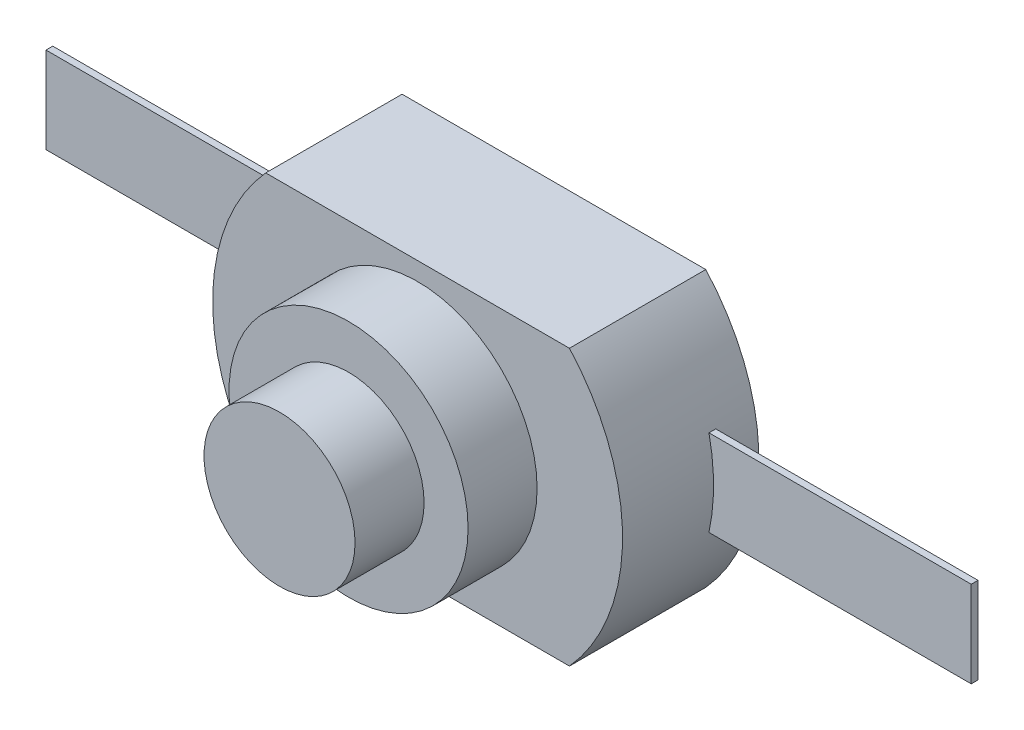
ISO-10303-21;
HEADER;
FILE_DESCRIPTION(('STEP AP214'),'2;1');
FILE_NAME('part.step','',(''),(''),'','','');
FILE_SCHEMA(('AUTOMOTIVE_DESIGN { 1 0 10303 214 1 1 1 1 }'));
ENDSEC;
DATA;
#1=APPLICATION_CONTEXT('core data for automotive mechanical design processes');
#2=APPLICATION_PROTOCOL_DEFINITION('international standard','automotive_design',2000,#1);
#3=PRODUCT_CONTEXT('',#1,'mechanical');
#4=PRODUCT('Part','Part','',(#3));
#5=PRODUCT_RELATED_PRODUCT_CATEGORY('part','',(#4));
#6=PRODUCT_DEFINITION_FORMATION('','',#4);
#7=PRODUCT_DEFINITION_CONTEXT('part definition',#1,'design');
#8=PRODUCT_DEFINITION('design','',#6,#7);
#9=PRODUCT_DEFINITION_SHAPE('','',#8);
#10=(LENGTH_UNIT() NAMED_UNIT(*) SI_UNIT(.MILLI.,.METRE.));
#11=(NAMED_UNIT(*) PLANE_ANGLE_UNIT() SI_UNIT($,.RADIAN.));
#12=(NAMED_UNIT(*) SI_UNIT($,.STERADIAN.) SOLID_ANGLE_UNIT());
#13=UNCERTAINTY_MEASURE_WITH_UNIT(LENGTH_MEASURE(1.E-05),#10,'distance_accuracy_value','');
#14=(GEOMETRIC_REPRESENTATION_CONTEXT(3) GLOBAL_UNCERTAINTY_ASSIGNED_CONTEXT((#13)) GLOBAL_UNIT_ASSIGNED_CONTEXT((#10,
#11,#12)) REPRESENTATION_CONTEXT('',''));
#15=CARTESIAN_POINT('',(0.,0.,0.));
#16=DIRECTION('',(0.,0.,1.));
#17=DIRECTION('',(1.,0.,0.));
#18=AXIS2_PLACEMENT_3D('',#15,#16,#17);
#19=CARTESIAN_POINT('',(0.,0.,4.0132));
#20=DIRECTION('',(0.,0.,-1.));
#21=DIRECTION('',(-1.,0.,0.));
#22=AXIS2_PLACEMENT_3D('',#19,#20,#21);
#23=CYLINDRICAL_SURFACE('',#22,6.0325);
#24=CARTESIAN_POINT('',(0.,0.,1.13500286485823));
#25=DIRECTION('',(0.,0.,1.));
#26=DIRECTION('',(1.,0.,0.));
#27=AXIS2_PLACEMENT_3D('',#24,#25,#26);
#28=CIRCLE('',#27,6.0325);
#29=CARTESIAN_POINT('',(-5.89730075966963,1.27,1.13500286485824));
#30=VERTEX_POINT('',#29);
#31=CARTESIAN_POINT('',(-5.89730075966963,-1.27,1.13500286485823));
#32=VERTEX_POINT('',#31);
#33=EDGE_CURVE('E52',#30,#32,#28,.T.);
#34=ORIENTED_EDGE('',*,*,#33,.F.);
#35=DIRECTION('',(0.,0.,-1.));
#36=VECTOR('',#35,1.);
#37=CARTESIAN_POINT('',(-5.89730075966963,1.27,4.0132));
#38=LINE('',#37,#36);
#39=CARTESIAN_POINT('',(-5.89730075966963,1.27,1.33422764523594));
#40=VERTEX_POINT('',#39);
#41=EDGE_CURVE('E47',#30,#40,#38,.F.);
#42=ORIENTED_EDGE('',*,*,#41,.T.);
#43=CARTESIAN_POINT('',(0.,0.,1.33422764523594));
#44=DIRECTION('',(0.,0.,-1.));
#45=DIRECTION('',(-1.,0.,0.));
#46=AXIS2_PLACEMENT_3D('',#43,#44,#45);
#47=CIRCLE('',#46,6.0325);
#48=CARTESIAN_POINT('',(-5.89730075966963,-1.27,1.33422764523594));
#49=VERTEX_POINT('',#48);
#50=EDGE_CURVE('E125',#49,#40,#47,.T.);
#51=ORIENTED_EDGE('',*,*,#50,.F.);
#52=DIRECTION('',(0.,0.,-1.));
#53=VECTOR('',#52,1.);
#54=CARTESIAN_POINT('',(-5.89730075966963,-1.27,4.0132));
#55=LINE('',#54,#53);
#56=EDGE_CURVE('E143',#32,#49,#55,.F.);
#57=ORIENTED_EDGE('',*,*,#56,.F.);
#58=EDGE_LOOP('',(#34,#42,#51,#57));
#59=FACE_BOUND('',#58,.T.);
#60=CARTESIAN_POINT('',(0.,0.,0.));
#61=DIRECTION('',(0.,0.,1.));
#62=DIRECTION('',(1.,0.,0.));
#63=AXIS2_PLACEMENT_3D('',#60,#61,#62);
#64=CIRCLE('',#63,6.0325);
#65=CARTESIAN_POINT('',(-4.4696783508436,4.0513,0.));
#66=VERTEX_POINT('',#65);
#67=CARTESIAN_POINT('',(-4.4696783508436,-4.0513,0.));
#68=VERTEX_POINT('',#67);
#69=EDGE_CURVE('E166',#66,#68,#64,.T.);
#70=ORIENTED_EDGE('',*,*,#69,.T.);
#71=DIRECTION('',(0.,0.,-1.));
#72=VECTOR('',#71,1.);
#73=CARTESIAN_POINT('',(-4.4696783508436,-4.0513,4.0132));
#74=LINE('',#73,#72);
#75=CARTESIAN_POINT('',(-4.4696783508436,-4.0513,4.0132));
#76=VERTEX_POINT('',#75);
#77=EDGE_CURVE('E195',#76,#68,#74,.T.);
#78=ORIENTED_EDGE('',*,*,#77,.F.);
#79=CARTESIAN_POINT('',(0.,0.,4.0132));
#80=DIRECTION('',(0.,0.,1.));
#81=DIRECTION('',(1.,0.,0.));
#82=AXIS2_PLACEMENT_3D('',#79,#80,#81);
#83=CIRCLE('',#82,6.0325);
#84=CARTESIAN_POINT('',(-4.4696783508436,4.0513,4.0132));
#85=VERTEX_POINT('',#84);
#86=EDGE_CURVE('E169',#85,#76,#83,.T.);
#87=ORIENTED_EDGE('',*,*,#86,.F.);
#88=DIRECTION('',(0.,0.,-1.));
#89=VECTOR('',#88,1.);
#90=CARTESIAN_POINT('',(-4.4696783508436,4.0513,4.0132));
#91=LINE('',#90,#89);
#92=EDGE_CURVE('E179',#85,#66,#91,.T.);
#93=ORIENTED_EDGE('',*,*,#92,.T.);
#94=EDGE_LOOP('',(#70,#78,#87,#93));
#95=FACE_BOUND('',#94,.T.);
#96=ADVANCED_FACE('F33',(#59,#95),#23,.T.);
#97=CARTESIAN_POINT('',(-4.4696783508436,-4.0513,4.0132));
#98=DIRECTION('',(0.,1.,0.));
#99=DIRECTION('',(-1.,0.,0.));
#100=AXIS2_PLACEMENT_3D('',#97,#98,#99);
#101=PLANE('',#100);
#102=DIRECTION('',(1.,0.,0.));
#103=VECTOR('',#102,1.);
#104=CARTESIAN_POINT('',(-4.4696783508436,-4.0513,0.));
#105=LINE('',#104,#103);
#106=CARTESIAN_POINT('',(4.4696783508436,-4.0513,0.));
#107=VERTEX_POINT('',#106);
#108=EDGE_CURVE('E182',#68,#107,#105,.T.);
#109=ORIENTED_EDGE('',*,*,#108,.T.);
#110=DIRECTION('',(0.,0.,-1.));
#111=VECTOR('',#110,1.);
#112=CARTESIAN_POINT('',(4.4696783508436,-4.0513,4.0132));
#113=LINE('',#112,#111);
#114=CARTESIAN_POINT('',(4.4696783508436,-4.0513,4.0132));
#115=VERTEX_POINT('',#114);
#116=EDGE_CURVE('E192',#115,#107,#113,.T.);
#117=ORIENTED_EDGE('',*,*,#116,.F.);
#118=DIRECTION('',(1.,0.,0.));
#119=VECTOR('',#118,1.);
#120=CARTESIAN_POINT('',(-4.4696783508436,-4.0513,4.0132));
#121=LINE('',#120,#119);
#122=EDGE_CURVE('E172',#76,#115,#121,.T.);
#123=ORIENTED_EDGE('',*,*,#122,.F.);
#124=ORIENTED_EDGE('',*,*,#77,.T.);
#125=EDGE_LOOP('',(#109,#117,#123,#124));
#126=FACE_BOUND('',#125,.T.);
#127=ADVANCED_FACE('F244',(#126),#101,.F.);
#128=CARTESIAN_POINT('',(0.,0.,4.0132));
#129=DIRECTION('',(0.,0.,-1.));
#130=DIRECTION('',(-1.,0.,0.));
#131=AXIS2_PLACEMENT_3D('',#128,#129,#130);
#132=CYLINDRICAL_SURFACE('',#131,6.0325);
#133=CARTESIAN_POINT('',(0.,0.,1.33422764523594));
#134=DIRECTION('',(0.,0.,-1.));
#135=DIRECTION('',(-1.,0.,0.));
#136=AXIS2_PLACEMENT_3D('',#133,#134,#135);
#137=CIRCLE('',#136,6.0325);
#138=CARTESIAN_POINT('',(5.89730075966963,1.27,1.33422764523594));
#139=VERTEX_POINT('',#138);
#140=CARTESIAN_POINT('',(5.89730075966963,-1.27,1.33422764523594));
#141=VERTEX_POINT('',#140);
#142=EDGE_CURVE('E40',#139,#141,#137,.T.);
#143=ORIENTED_EDGE('',*,*,#142,.F.);
#144=DIRECTION('',(0.,0.,-1.));
#145=VECTOR('',#144,1.);
#146=CARTESIAN_POINT('',(5.89730075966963,1.27,4.0132));
#147=LINE('',#146,#145);
#148=CARTESIAN_POINT('',(5.89730075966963,1.27,1.13500286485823));
#149=VERTEX_POINT('',#148);
#150=EDGE_CURVE('E11',#139,#149,#147,.T.);
#151=ORIENTED_EDGE('',*,*,#150,.T.);
#152=CARTESIAN_POINT('',(0.,0.,1.13500286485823));
#153=DIRECTION('',(0.,0.,1.));
#154=DIRECTION('',(1.,0.,0.));
#155=AXIS2_PLACEMENT_3D('',#152,#153,#154);
#156=CIRCLE('',#155,6.0325);
#157=CARTESIAN_POINT('',(5.89730075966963,-1.27,1.13500286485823));
#158=VERTEX_POINT('',#157);
#159=EDGE_CURVE('E201',#158,#149,#156,.T.);
#160=ORIENTED_EDGE('',*,*,#159,.F.);
#161=DIRECTION('',(0.,0.,-1.));
#162=VECTOR('',#161,1.);
#163=CARTESIAN_POINT('',(5.89730075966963,-1.27,4.0132));
#164=LINE('',#163,#162);
#165=EDGE_CURVE('E198',#141,#158,#164,.T.);
#166=ORIENTED_EDGE('',*,*,#165,.F.);
#167=EDGE_LOOP('',(#143,#151,#160,#166));
#168=FACE_BOUND('',#167,.T.);
#169=CARTESIAN_POINT('',(0.,0.,0.));
#170=DIRECTION('',(0.,0.,1.));
#171=DIRECTION('',(1.,0.,0.));
#172=AXIS2_PLACEMENT_3D('',#169,#170,#171);
#173=CIRCLE('',#172,6.0325);
#174=CARTESIAN_POINT('',(4.4696783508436,4.0513,0.));
#175=VERTEX_POINT('',#174);
#176=EDGE_CURVE('E184',#107,#175,#173,.T.);
#177=ORIENTED_EDGE('',*,*,#176,.T.);
#178=DIRECTION('',(0.,0.,-1.));
#179=VECTOR('',#178,1.);
#180=CARTESIAN_POINT('',(4.4696783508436,4.0513,4.0132));
#181=LINE('',#180,#179);
#182=CARTESIAN_POINT('',(4.4696783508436,4.0513,4.0132));
#183=VERTEX_POINT('',#182);
#184=EDGE_CURVE('E189',#183,#175,#181,.T.);
#185=ORIENTED_EDGE('',*,*,#184,.F.);
#186=CARTESIAN_POINT('',(0.,0.,4.0132));
#187=DIRECTION('',(0.,0.,1.));
#188=DIRECTION('',(1.,0.,0.));
#189=AXIS2_PLACEMENT_3D('',#186,#187,#188);
#190=CIRCLE('',#189,6.0325);
#191=EDGE_CURVE('E175',#115,#183,#190,.T.);
#192=ORIENTED_EDGE('',*,*,#191,.F.);
#193=ORIENTED_EDGE('',*,*,#116,.T.);
#194=EDGE_LOOP('',(#177,#185,#192,#193));
#195=FACE_BOUND('',#194,.T.);
#196=ADVANCED_FACE('F240',(#168,#195),#132,.T.);
#197=CARTESIAN_POINT('',(-4.4696783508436,4.0513,4.0132));
#198=DIRECTION('',(0.,-1.,0.));
#199=DIRECTION('',(0.,0.,-1.));
#200=AXIS2_PLACEMENT_3D('',#197,#198,#199);
#201=PLANE('',#200);
#202=DIRECTION('',(-1.,0.,0.));
#203=VECTOR('',#202,1.);
#204=CARTESIAN_POINT('',(-4.4696783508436,4.0513,0.));
#205=LINE('',#204,#203);
#206=EDGE_CURVE('E173',#175,#66,#205,.T.);
#207=ORIENTED_EDGE('',*,*,#206,.T.);
#208=ORIENTED_EDGE('',*,*,#92,.F.);
#209=DIRECTION('',(-1.,0.,0.));
#210=VECTOR('',#209,1.);
#211=CARTESIAN_POINT('',(-4.4696783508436,4.0513,4.0132));
#212=LINE('',#211,#210);
#213=EDGE_CURVE('E177',#183,#85,#212,.T.);
#214=ORIENTED_EDGE('',*,*,#213,.F.);
#215=ORIENTED_EDGE('',*,*,#184,.T.);
#216=EDGE_LOOP('',(#207,#208,#214,#215));
#217=FACE_BOUND('',#216,.T.);
#218=ADVANCED_FACE('F243',(#217),#201,.F.);
#219=CARTESIAN_POINT('',(0.,0.,4.0132));
#220=DIRECTION('',(0.,0.,1.));
#221=DIRECTION('',(1.,0.,0.));
#222=AXIS2_PLACEMENT_3D('',#219,#220,#221);
#223=PLANE('',#222);
#224=CARTESIAN_POINT('',(0.,0.,4.0132));
#225=DIRECTION('',(0.,0.,1.));
#226=DIRECTION('',(1.,0.,0.));
#227=AXIS2_PLACEMENT_3D('',#224,#225,#226);
#228=CIRCLE('',#227,3.5179);
#229=CARTESIAN_POINT('',(3.5179,0.,4.0132));
#230=VERTEX_POINT('',#229);
#231=EDGE_CURVE('E160',#230,#230,#228,.T.);
#232=ORIENTED_EDGE('',*,*,#231,.F.);
#233=EDGE_LOOP('',(#232));
#234=FACE_BOUND('',#233,.T.);
#235=ORIENTED_EDGE('',*,*,#86,.T.);
#236=ORIENTED_EDGE('',*,*,#122,.T.);
#237=ORIENTED_EDGE('',*,*,#191,.T.);
#238=ORIENTED_EDGE('',*,*,#213,.T.);
#239=EDGE_LOOP('',(#235,#236,#237,#238));
#240=FACE_BOUND('',#239,.T.);
#241=ADVANCED_FACE('F261',(#234,#240),#223,.T.);
#242=CARTESIAN_POINT('',(0.,0.,0.));
#243=DIRECTION('',(0.,0.,1.));
#244=DIRECTION('',(1.,0.,0.));
#245=AXIS2_PLACEMENT_3D('',#242,#243,#244);
#246=PLANE('',#245);
#247=ORIENTED_EDGE('',*,*,#69,.F.);
#248=ORIENTED_EDGE('',*,*,#206,.F.);
#249=ORIENTED_EDGE('',*,*,#176,.F.);
#250=ORIENTED_EDGE('',*,*,#108,.F.);
#251=EDGE_LOOP('',(#247,#248,#249,#250));
#252=FACE_BOUND('',#251,.T.);
#253=ADVANCED_FACE('F256',(#252),#246,.F.);
#254=CARTESIAN_POINT('',(0.,0.,6.0452));
#255=DIRECTION('',(0.,0.,-1.));
#256=DIRECTION('',(-1.,0.,0.));
#257=AXIS2_PLACEMENT_3D('',#254,#255,#256);
#258=CYLINDRICAL_SURFACE('',#257,3.5179);
#259=CARTESIAN_POINT('',(0.,0.,6.0452));
#260=DIRECTION('',(0.,0.,1.));
#261=DIRECTION('',(1.,0.,0.));
#262=AXIS2_PLACEMENT_3D('',#259,#260,#261);
#263=CIRCLE('',#262,3.5179);
#264=CARTESIAN_POINT('',(3.5179,0.,6.0452));
#265=VERTEX_POINT('',#264);
#266=EDGE_CURVE('E163',#265,#265,#263,.T.);
#267=ORIENTED_EDGE('',*,*,#266,.F.);
#268=EDGE_LOOP('',(#267));
#269=FACE_BOUND('',#268,.T.);
#270=ORIENTED_EDGE('',*,*,#231,.T.);
#271=EDGE_LOOP('',(#270));
#272=FACE_BOUND('',#271,.T.);
#273=ADVANCED_FACE('F272',(#269,#272),#258,.T.);
#274=CARTESIAN_POINT('',(0.,0.,6.0452));
#275=DIRECTION('',(0.,0.,1.));
#276=DIRECTION('',(1.,0.,0.));
#277=AXIS2_PLACEMENT_3D('',#274,#275,#276);
#278=PLANE('',#277);
#279=CARTESIAN_POINT('',(0.,0.,6.0452));
#280=DIRECTION('',(0.,0.,1.));
#281=DIRECTION('',(1.,0.,0.));
#282=AXIS2_PLACEMENT_3D('',#279,#280,#281);
#283=CIRCLE('',#282,2.2225);
#284=CARTESIAN_POINT('',(2.2225,0.,6.0452));
#285=VERTEX_POINT('',#284);
#286=EDGE_CURVE('E156',#285,#285,#283,.T.);
#287=ORIENTED_EDGE('',*,*,#286,.F.);
#288=EDGE_LOOP('',(#287));
#289=FACE_BOUND('',#288,.T.);
#290=ORIENTED_EDGE('',*,*,#266,.T.);
#291=EDGE_LOOP('',(#290));
#292=FACE_BOUND('',#291,.T.);
#293=ADVANCED_FACE('F278',(#289,#292),#278,.T.);
#294=CARTESIAN_POINT('',(0.,0.,8.0772));
#295=DIRECTION('',(0.,0.,-1.));
#296=DIRECTION('',(-1.,0.,0.));
#297=AXIS2_PLACEMENT_3D('',#294,#295,#296);
#298=CYLINDRICAL_SURFACE('',#297,2.2225);
#299=CARTESIAN_POINT('',(0.,0.,8.0772));
#300=DIRECTION('',(0.,0.,1.));
#301=DIRECTION('',(1.,0.,0.));
#302=AXIS2_PLACEMENT_3D('',#299,#300,#301);
#303=CIRCLE('',#302,2.2225);
#304=CARTESIAN_POINT('',(2.2225,0.,8.0772));
#305=VERTEX_POINT('',#304);
#306=EDGE_CURVE('E157',#305,#305,#303,.T.);
#307=ORIENTED_EDGE('',*,*,#306,.F.);
#308=EDGE_LOOP('',(#307));
#309=FACE_BOUND('',#308,.T.);
#310=ORIENTED_EDGE('',*,*,#286,.T.);
#311=EDGE_LOOP('',(#310));
#312=FACE_BOUND('',#311,.T.);
#313=ADVANCED_FACE('F282',(#309,#312),#298,.T.);
#314=CARTESIAN_POINT('',(0.,0.,8.0772));
#315=DIRECTION('',(0.,0.,1.));
#316=DIRECTION('',(1.,0.,0.));
#317=AXIS2_PLACEMENT_3D('',#314,#315,#316);
#318=PLANE('',#317);
#319=ORIENTED_EDGE('',*,*,#306,.T.);
#320=EDGE_LOOP('',(#319));
#321=FACE_BOUND('',#320,.T.);
#322=ADVANCED_FACE('F286',(#321),#318,.T.);
#323=CARTESIAN_POINT('',(13.6168945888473,1.27,1.13500286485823));
#324=DIRECTION('',(-1.,0.,0.));
#325=DIRECTION('',(0.,0.,1.));
#326=AXIS2_PLACEMENT_3D('',#323,#324,#325);
#327=PLANE('',#326);
#328=DIRECTION('',(0.,0.,-1.));
#329=VECTOR('',#328,1.);
#330=CARTESIAN_POINT('',(13.6168945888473,-1.27,1.13500286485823));
#331=LINE('',#330,#329);
#332=CARTESIAN_POINT('',(13.6168945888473,-1.27,1.33422764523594));
#333=VERTEX_POINT('',#332);
#334=CARTESIAN_POINT('',(13.6168945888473,-1.27,1.13500286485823));
#335=VERTEX_POINT('',#334);
#336=EDGE_CURVE('E217',#333,#335,#331,.T.);
#337=ORIENTED_EDGE('',*,*,#336,.T.);
#338=DIRECTION('',(0.,-1.,0.));
#339=VECTOR('',#338,1.);
#340=CARTESIAN_POINT('',(13.6168945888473,1.27,1.13500286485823));
#341=LINE('',#340,#339);
#342=CARTESIAN_POINT('',(13.6168945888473,1.27,1.13500286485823));
#343=VERTEX_POINT('',#342);
#344=EDGE_CURVE('E149',#343,#335,#341,.T.);
#345=ORIENTED_EDGE('',*,*,#344,.F.);
#346=DIRECTION('',(0.,0.,-1.));
#347=VECTOR('',#346,1.);
#348=CARTESIAN_POINT('',(13.6168945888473,1.27,1.13500286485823));
#349=LINE('',#348,#347);
#350=CARTESIAN_POINT('',(13.6168945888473,1.27,1.33422764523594));
#351=VERTEX_POINT('',#350);
#352=EDGE_CURVE('E127',#351,#343,#349,.T.);
#353=ORIENTED_EDGE('',*,*,#352,.F.);
#354=DIRECTION('',(0.,-1.,0.));
#355=VECTOR('',#354,1.);
#356=CARTESIAN_POINT('',(13.6168945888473,1.27,1.33422764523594));
#357=LINE('',#356,#355);
#358=EDGE_CURVE('E144',#351,#333,#357,.T.);
#359=ORIENTED_EDGE('',*,*,#358,.T.);
#360=EDGE_LOOP('',(#337,#345,#353,#359));
#361=FACE_BOUND('',#360,.T.);
#362=ADVANCED_FACE('F236',(#361),#327,.F.);
#363=CARTESIAN_POINT('',(0.,1.27,0.));
#364=DIRECTION('',(0.,1.,0.));
#365=DIRECTION('',(0.,0.,1.));
#366=AXIS2_PLACEMENT_3D('',#363,#364,#365);
#367=PLANE('',#366);
#368=ORIENTED_EDGE('',*,*,#150,.F.);
#369=DIRECTION('',(1.,0.,0.));
#370=VECTOR('',#369,1.);
#371=CARTESIAN_POINT('',(-13.6168945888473,1.27,1.33422764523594));
#372=LINE('',#371,#370);
#373=EDGE_CURVE('E128',#139,#351,#372,.T.);
#374=ORIENTED_EDGE('',*,*,#373,.T.);
#375=ORIENTED_EDGE('',*,*,#352,.T.);
#376=DIRECTION('',(-1.,0.,0.));
#377=VECTOR('',#376,1.);
#378=CARTESIAN_POINT('',(-13.6168945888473,1.27,1.13500286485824));
#379=LINE('',#378,#377);
#380=EDGE_CURVE('E227',#343,#149,#379,.T.);
#381=ORIENTED_EDGE('',*,*,#380,.T.);
#382=EDGE_LOOP('',(#368,#374,#375,#381));
#383=FACE_BOUND('',#382,.T.);
#384=ADVANCED_FACE('F239',(#383),#367,.T.);
#385=CARTESIAN_POINT('',(0.,-1.27,0.));
#386=DIRECTION('',(0.,1.,0.));
#387=DIRECTION('',(0.,0.,1.));
#388=AXIS2_PLACEMENT_3D('',#385,#386,#387);
#389=PLANE('',#388);
#390=DIRECTION('',(1.,0.,0.));
#391=VECTOR('',#390,1.);
#392=CARTESIAN_POINT('',(-13.6168945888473,-1.27,1.33422764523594));
#393=LINE('',#392,#391);
#394=EDGE_CURVE('E209',#141,#333,#393,.T.);
#395=ORIENTED_EDGE('',*,*,#394,.F.);
#396=ORIENTED_EDGE('',*,*,#165,.T.);
#397=DIRECTION('',(-1.,0.,0.));
#398=VECTOR('',#397,1.);
#399=CARTESIAN_POINT('',(-13.6168945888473,-1.27,1.13500286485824));
#400=LINE('',#399,#398);
#401=EDGE_CURVE('E138',#335,#158,#400,.T.);
#402=ORIENTED_EDGE('',*,*,#401,.F.);
#403=ORIENTED_EDGE('',*,*,#336,.F.);
#404=EDGE_LOOP('',(#395,#396,#402,#403));
#405=FACE_BOUND('',#404,.T.);
#406=ADVANCED_FACE('F214',(#405),#389,.F.);
#407=CARTESIAN_POINT('',(-13.6168945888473,1.27,1.13500286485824));
#408=DIRECTION('',(0.,0.,1.));
#409=DIRECTION('',(1.,0.,0.));
#410=AXIS2_PLACEMENT_3D('',#407,#408,#409);
#411=PLANE('',#410);
#412=ORIENTED_EDGE('',*,*,#401,.T.);
#413=ORIENTED_EDGE('',*,*,#159,.T.);
#414=ORIENTED_EDGE('',*,*,#380,.F.);
#415=ORIENTED_EDGE('',*,*,#344,.T.);
#416=EDGE_LOOP('',(#412,#413,#414,#415));
#417=FACE_BOUND('',#416,.T.);
#418=ADVANCED_FACE('F232',(#417),#411,.F.);
#419=CARTESIAN_POINT('',(-13.6168945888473,1.27,1.33422764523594));
#420=DIRECTION('',(0.,0.,-1.));
#421=DIRECTION('',(-1.,0.,0.));
#422=AXIS2_PLACEMENT_3D('',#419,#420,#421);
#423=PLANE('',#422);
#424=ORIENTED_EDGE('',*,*,#373,.F.);
#425=ORIENTED_EDGE('',*,*,#142,.T.);
#426=ORIENTED_EDGE('',*,*,#394,.T.);
#427=ORIENTED_EDGE('',*,*,#358,.F.);
#428=EDGE_LOOP('',(#424,#425,#426,#427));
#429=FACE_BOUND('',#428,.T.);
#430=ADVANCED_FACE('F207',(#429),#423,.F.);
#431=CARTESIAN_POINT('',(-13.6168945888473,-1.27,1.33422764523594));
#432=VERTEX_POINT('',#431);
#433=EDGE_CURVE('E218',#432,#49,#393,.T.);
#434=ORIENTED_EDGE('',*,*,#433,.T.);
#435=ORIENTED_EDGE('',*,*,#50,.T.);
#436=CARTESIAN_POINT('',(-13.6168945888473,1.27,1.33422764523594));
#437=VERTEX_POINT('',#436);
#438=EDGE_CURVE('E118',#437,#40,#372,.T.);
#439=ORIENTED_EDGE('',*,*,#438,.F.);
#440=DIRECTION('',(0.,-1.,0.));
#441=VECTOR('',#440,1.);
#442=CARTESIAN_POINT('',(-13.6168945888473,1.27,1.33422764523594));
#443=LINE('',#442,#441);
#444=EDGE_CURVE('E123',#437,#432,#443,.T.);
#445=ORIENTED_EDGE('',*,*,#444,.T.);
#446=EDGE_LOOP('',(#434,#435,#439,#445));
#447=FACE_BOUND('',#446,.T.);
#448=ADVANCED_FACE('F121',(#447),#423,.F.);
#449=CARTESIAN_POINT('',(-13.6168945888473,1.27,1.13500286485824));
#450=VERTEX_POINT('',#449);
#451=EDGE_CURVE('E134',#30,#450,#379,.T.);
#452=ORIENTED_EDGE('',*,*,#451,.F.);
#453=ORIENTED_EDGE('',*,*,#33,.T.);
#454=CARTESIAN_POINT('',(-13.6168945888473,-1.27,1.13500286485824));
#455=VERTEX_POINT('',#454);
#456=EDGE_CURVE('E224',#32,#455,#400,.T.);
#457=ORIENTED_EDGE('',*,*,#456,.T.);
#458=DIRECTION('',(0.,-1.,0.));
#459=VECTOR('',#458,1.);
#460=CARTESIAN_POINT('',(-13.6168945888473,1.27,1.13500286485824));
#461=LINE('',#460,#459);
#462=EDGE_CURVE('E226',#450,#455,#461,.T.);
#463=ORIENTED_EDGE('',*,*,#462,.F.);
#464=EDGE_LOOP('',(#452,#453,#457,#463));
#465=FACE_BOUND('',#464,.T.);
#466=ADVANCED_FACE('F300',(#465),#411,.F.);
#467=ORIENTED_EDGE('',*,*,#41,.F.);
#468=ORIENTED_EDGE('',*,*,#451,.T.);
#469=DIRECTION('',(0.,0.,1.));
#470=VECTOR('',#469,1.);
#471=CARTESIAN_POINT('',(-13.6168945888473,1.27,1.13500286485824));
#472=LINE('',#471,#470);
#473=EDGE_CURVE('E131',#450,#437,#472,.T.);
#474=ORIENTED_EDGE('',*,*,#473,.T.);
#475=ORIENTED_EDGE('',*,*,#438,.T.);
#476=EDGE_LOOP('',(#467,#468,#474,#475));
#477=FACE_BOUND('',#476,.T.);
#478=ADVANCED_FACE('F132',(#477),#367,.T.);
#479=ORIENTED_EDGE('',*,*,#456,.F.);
#480=ORIENTED_EDGE('',*,*,#56,.T.);
#481=ORIENTED_EDGE('',*,*,#433,.F.);
#482=DIRECTION('',(0.,0.,1.));
#483=VECTOR('',#482,1.);
#484=CARTESIAN_POINT('',(-13.6168945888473,-1.27,1.13500286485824));
#485=LINE('',#484,#483);
#486=EDGE_CURVE('E142',#455,#432,#485,.T.);
#487=ORIENTED_EDGE('',*,*,#486,.F.);
#488=EDGE_LOOP('',(#479,#480,#481,#487));
#489=FACE_BOUND('',#488,.T.);
#490=ADVANCED_FACE('F293',(#489),#389,.F.);
#491=CARTESIAN_POINT('',(-13.6168945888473,1.27,1.13500286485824));
#492=DIRECTION('',(1.,0.,0.));
#493=DIRECTION('',(0.,0.,-1.));
#494=AXIS2_PLACEMENT_3D('',#491,#492,#493);
#495=PLANE('',#494);
#496=ORIENTED_EDGE('',*,*,#486,.T.);
#497=ORIENTED_EDGE('',*,*,#444,.F.);
#498=ORIENTED_EDGE('',*,*,#473,.F.);
#499=ORIENTED_EDGE('',*,*,#462,.T.);
#500=EDGE_LOOP('',(#496,#497,#498,#499));
#501=FACE_BOUND('',#500,.T.);
#502=ADVANCED_FACE('F140',(#501),#495,.F.);
#503=CLOSED_SHELL('',(#96,#127,#196,#218,#241,#253,#273,#293,#313,#322,#362,#384,#406,#418,#430,
#448,#466,#478,#490,#502));
#504=MANIFOLD_SOLID_BREP('B2',#503);
#505=ADVANCED_BREP_SHAPE_REPRESENTATION('',(#18,#504),#14);
#506=SHAPE_DEFINITION_REPRESENTATION(#9,#505);
ENDSEC;
END-ISO-10303-21;
